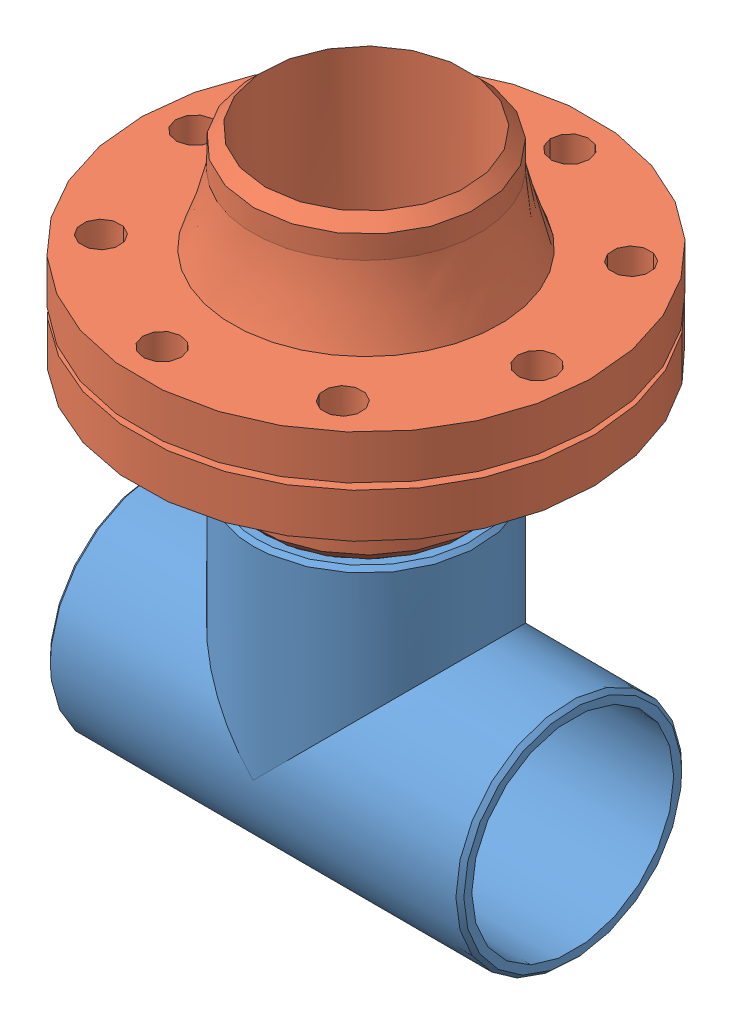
SolidWorks assembly assemblyfitting without acp.sldasm, configuration 4 inch (file format 9000). Lengths in mm.
Overall size (303.27 324.32 303.27).
3 component instances, 2 part files, 4 mates.
Components (placement in the parent):
- straight tee inch-1: straight tee inch.sldprt [Tee Inch 4 Sch40] at origin size (229.3 171.8 114.3)
- welding neck flange-1: welding neck flange.sldprt [WNeck Flange 150-NPS4] at (0 179.324 0) x (0.908284 0 -0.418355) z (0 1 0) size (228.6 228.6 86.27)
- welding neck flange-2: welding neck flange.sldprt [WNeck Flange 150-NPS4] at (0 182.499 0) x (0.30067 0 0.953728) z (0 -1 0) size (228.6 228.6 86.27)
Mates (geometry in assembly coordinates):
- Concentric3: concentric aligned: cylinder of straight tee inch-1 through (0 104.648 0) axis (0 -1 0) radius 51.1302; cylinder of welding neck flange-1 through (0 180.9125 0) axis (0 -1 0) radius 51.181
- Coincident3: coincident aligned: plane of straight tee inch-1 through (0 104.648 0) normal (0 1 0); circle of welding neck flange-1
- Concentric4: concentric anti-aligned: cylinder of welding neck flange-1 through (0 180.9125 0) axis (0 -1 0) radius 51.181; cylinder of welding neck flange-2 through (0 180.9105 0) axis (0 1 0) radius 51.181
- Coincident4: coincident anti-aligned: plane of welding neck flange-2 through (0 180.9115 0) normal (0 -1 0); plane of welding neck flange-1 through (0 180.9115 0) normal (0 1 0)
